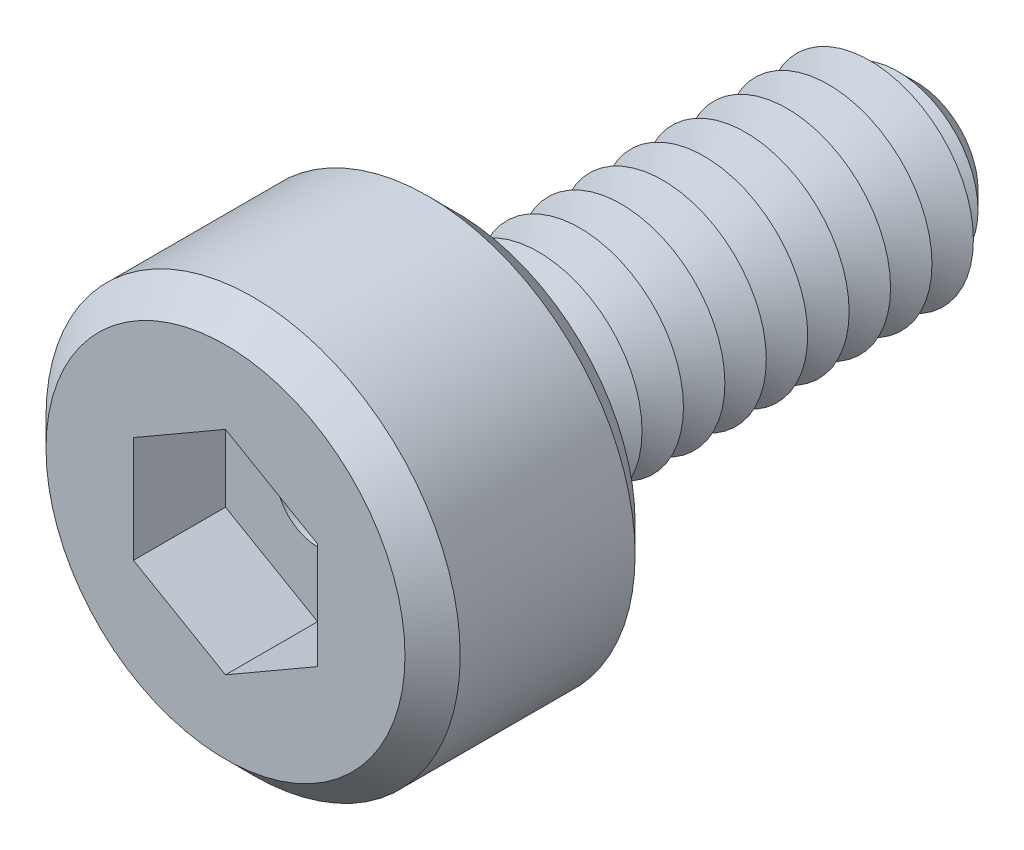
ISO-10303-21;
HEADER;
FILE_DESCRIPTION(('STEP AP214'),'2;1');
FILE_NAME('part.step','',(''),(''),'','','');
FILE_SCHEMA(('AUTOMOTIVE_DESIGN { 1 0 10303 214 1 1 1 1 }'));
ENDSEC;
DATA;
#1=APPLICATION_CONTEXT('core data for automotive mechanical design processes');
#2=APPLICATION_PROTOCOL_DEFINITION('international standard','automotive_design',2000,#1);
#3=PRODUCT_CONTEXT('',#1,'mechanical');
#4=PRODUCT('Part','Part','',(#3));
#5=PRODUCT_RELATED_PRODUCT_CATEGORY('part','',(#4));
#6=PRODUCT_DEFINITION_FORMATION('','',#4);
#7=PRODUCT_DEFINITION_CONTEXT('part definition',#1,'design');
#8=PRODUCT_DEFINITION('design','',#6,#7);
#9=PRODUCT_DEFINITION_SHAPE('','',#8);
#10=(LENGTH_UNIT() NAMED_UNIT(*) SI_UNIT(.MILLI.,.METRE.));
#11=(NAMED_UNIT(*) PLANE_ANGLE_UNIT() SI_UNIT($,.RADIAN.));
#12=(NAMED_UNIT(*) SI_UNIT($,.STERADIAN.) SOLID_ANGLE_UNIT());
#13=UNCERTAINTY_MEASURE_WITH_UNIT(LENGTH_MEASURE(1.E-05),#10,'distance_accuracy_value','');
#14=(GEOMETRIC_REPRESENTATION_CONTEXT(3) GLOBAL_UNCERTAINTY_ASSIGNED_CONTEXT((#13)) GLOBAL_UNIT_ASSIGNED_CONTEXT((#10,
#11,#12)) REPRESENTATION_CONTEXT('',''));
#15=CARTESIAN_POINT('',(0.,0.,0.));
#16=DIRECTION('',(0.,0.,1.));
#17=DIRECTION('',(1.,0.,0.));
#18=AXIS2_PLACEMENT_3D('',#15,#16,#17);
#19=CARTESIAN_POINT('',(0.,0.,2.5));
#20=DIRECTION('',(0.,0.,-1.));
#21=DIRECTION('',(-1.,0.,0.));
#22=AXIS2_PLACEMENT_3D('',#19,#20,#21);
#23=CYLINDRICAL_SURFACE('',#22,2.25);
#24=CARTESIAN_POINT('',(0.,0.,0.299999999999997));
#25=DIRECTION('',(0.,0.,1.));
#26=DIRECTION('',(1.,0.,0.));
#27=AXIS2_PLACEMENT_3D('',#24,#25,#26);
#28=CIRCLE('',#27,2.25);
#29=CARTESIAN_POINT('',(2.25,0.,0.299999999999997));
#30=VERTEX_POINT('',#29);
#31=EDGE_CURVE('E264',#30,#30,#28,.T.);
#32=ORIENTED_EDGE('',*,*,#31,.T.);
#33=EDGE_LOOP('',(#32));
#34=FACE_BOUND('',#33,.T.);
#35=CARTESIAN_POINT('',(0.,0.,2.2));
#36=DIRECTION('',(0.,0.,1.));
#37=DIRECTION('',(1.,0.,0.));
#38=AXIS2_PLACEMENT_3D('',#35,#36,#37);
#39=CIRCLE('',#38,2.25);
#40=CARTESIAN_POINT('',(2.25,0.,2.2));
#41=VERTEX_POINT('',#40);
#42=EDGE_CURVE('E257',#41,#41,#39,.F.);
#43=ORIENTED_EDGE('',*,*,#42,.T.);
#44=EDGE_LOOP('',(#43));
#45=FACE_BOUND('',#44,.T.);
#46=ADVANCED_FACE('F39',(#34,#45),#23,.T.);
#47=CARTESIAN_POINT('',(0.,0.,2.5));
#48=DIRECTION('',(0.,0.,1.));
#49=DIRECTION('',(1.,0.,0.));
#50=AXIS2_PLACEMENT_3D('',#47,#48,#49);
#51=PLANE('',#50);
#52=CARTESIAN_POINT('',(0.,0.,2.5));
#53=DIRECTION('',(0.,0.,1.));
#54=DIRECTION('',(1.,0.,0.));
#55=AXIS2_PLACEMENT_3D('',#52,#53,#54);
#56=CIRCLE('',#55,1.95);
#57=CARTESIAN_POINT('',(1.95,0.,2.5));
#58=VERTEX_POINT('',#57);
#59=EDGE_CURVE('E11',#58,#58,#56,.T.);
#60=ORIENTED_EDGE('',*,*,#59,.T.);
#61=EDGE_LOOP('',(#60));
#62=FACE_BOUND('',#61,.T.);
#63=DIRECTION('',(-0.866025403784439,0.5,0.));
#64=VECTOR('',#63,1.);
#65=CARTESIAN_POINT('',(0.999999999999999,0.577350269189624,2.5));
#66=LINE('',#65,#64);
#67=CARTESIAN_POINT('',(0.999999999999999,0.577350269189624,2.5));
#68=VERTEX_POINT('',#67);
#69=CARTESIAN_POINT('',(0.,1.15470053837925,2.5));
#70=VERTEX_POINT('',#69);
#71=EDGE_CURVE('E55',#68,#70,#66,.T.);
#72=ORIENTED_EDGE('',*,*,#71,.F.);
#73=DIRECTION('',(0.,1.,0.));
#74=VECTOR('',#73,1.);
#75=CARTESIAN_POINT('',(1.,-0.577350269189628,2.5));
#76=LINE('',#75,#74);
#77=CARTESIAN_POINT('',(1.,-0.577350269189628,2.5));
#78=VERTEX_POINT('',#77);
#79=EDGE_CURVE('E150',#78,#68,#76,.T.);
#80=ORIENTED_EDGE('',*,*,#79,.F.);
#81=DIRECTION('',(0.866025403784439,0.5,0.));
#82=VECTOR('',#81,1.);
#83=CARTESIAN_POINT('',(0.,-1.15470053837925,2.5));
#84=LINE('',#83,#82);
#85=CARTESIAN_POINT('',(0.,-1.15470053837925,2.5));
#86=VERTEX_POINT('',#85);
#87=EDGE_CURVE('E147',#86,#78,#84,.T.);
#88=ORIENTED_EDGE('',*,*,#87,.F.);
#89=DIRECTION('',(0.866025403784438,-0.5,0.));
#90=VECTOR('',#89,1.);
#91=CARTESIAN_POINT('',(-1.,-0.577350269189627,2.5));
#92=LINE('',#91,#90);
#93=CARTESIAN_POINT('',(-1.,-0.577350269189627,2.5));
#94=VERTEX_POINT('',#93);
#95=EDGE_CURVE('E103',#94,#86,#92,.T.);
#96=ORIENTED_EDGE('',*,*,#95,.F.);
#97=DIRECTION('',(0.,-1.,0.));
#98=VECTOR('',#97,1.);
#99=CARTESIAN_POINT('',(-1.,0.577350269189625,2.5));
#100=LINE('',#99,#98);
#101=CARTESIAN_POINT('',(-1.,0.577350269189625,2.5));
#102=VERTEX_POINT('',#101);
#103=EDGE_CURVE('E142',#102,#94,#100,.T.);
#104=ORIENTED_EDGE('',*,*,#103,.F.);
#105=DIRECTION('',(-0.866025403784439,-0.5,0.));
#106=VECTOR('',#105,1.);
#107=CARTESIAN_POINT('',(0.,1.15470053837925,2.5));
#108=LINE('',#107,#106);
#109=EDGE_CURVE('E137',#70,#102,#108,.T.);
#110=ORIENTED_EDGE('',*,*,#109,.F.);
#111=EDGE_LOOP('',(#72,#80,#88,#96,#104,#110));
#112=FACE_BOUND('',#111,.T.);
#113=ADVANCED_FACE('F282',(#62,#112),#51,.T.);
#114=CARTESIAN_POINT('',(0.,0.,0.));
#115=DIRECTION('',(0.,0.,1.));
#116=DIRECTION('',(1.,0.,0.));
#117=AXIS2_PLACEMENT_3D('',#114,#115,#116);
#118=PLANE('',#117);
#119=CARTESIAN_POINT('',(0.,0.,0.));
#120=DIRECTION('',(0.,0.,1.));
#121=DIRECTION('',(1.,0.,0.));
#122=AXIS2_PLACEMENT_3D('',#119,#120,#121);
#123=CIRCLE('',#122,1.95);
#124=CARTESIAN_POINT('',(1.95,0.,0.));
#125=VERTEX_POINT('',#124);
#126=EDGE_CURVE('E48',#125,#125,#123,.F.);
#127=ORIENTED_EDGE('',*,*,#126,.T.);
#128=EDGE_LOOP('',(#127));
#129=FACE_BOUND('',#128,.T.);
#130=CARTESIAN_POINT('',(0.,0.,0.));
#131=DIRECTION('',(0.,0.,1.));
#132=DIRECTION('',(1.,0.,0.));
#133=AXIS2_PLACEMENT_3D('',#130,#131,#132);
#134=CIRCLE('',#133,1.125);
#135=CARTESIAN_POINT('',(1.125,0.,0.));
#136=VERTEX_POINT('',#135);
#137=EDGE_CURVE('E249',#136,#136,#134,.T.);
#138=ORIENTED_EDGE('',*,*,#137,.T.);
#139=EDGE_LOOP('',(#138));
#140=FACE_BOUND('',#139,.T.);
#141=ADVANCED_FACE('F271',(#129,#140),#118,.F.);
#142=CARTESIAN_POINT('',(0.,0.,0.));
#143=DIRECTION('',(0.,0.,1.));
#144=DIRECTION('',(1.,0.,0.));
#145=AXIS2_PLACEMENT_3D('',#142,#143,#144);
#146=CONICAL_SURFACE('',#145,1.125,1.0471975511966);
#147=CARTESIAN_POINT('',(0.,0.,-0.225));
#148=DIRECTION('',(0.,0.,1.));
#149=DIRECTION('',(1.,0.,0.));
#150=AXIS2_PLACEMENT_3D('',#147,#148,#149);
#151=CIRCLE('',#150,0.735288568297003);
#152=CARTESIAN_POINT('',(0.735288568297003,0.,-0.225));
#153=VERTEX_POINT('',#152);
#154=EDGE_CURVE('E245',#153,#153,#151,.T.);
#155=ORIENTED_EDGE('',*,*,#154,.T.);
#156=EDGE_LOOP('',(#155));
#157=FACE_BOUND('',#156,.T.);
#158=ORIENTED_EDGE('',*,*,#137,.F.);
#159=EDGE_LOOP('',(#158));
#160=FACE_BOUND('',#159,.T.);
#161=ADVANCED_FACE('F420',(#157,#160),#146,.T.);
#162=CARTESIAN_POINT('',(0.,0.,-0.225));
#163=DIRECTION('',(0.,0.,-1.));
#164=DIRECTION('',(-1.,0.,0.));
#165=AXIS2_PLACEMENT_3D('',#162,#163,#164);
#166=CONICAL_SURFACE('',#165,0.735288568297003,1.0471975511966);
#167=CARTESIAN_POINT('',(0.,0.,-0.45));
#168=DIRECTION('',(0.,0.,1.));
#169=DIRECTION('',(1.,0.,0.));
#170=AXIS2_PLACEMENT_3D('',#167,#168,#169);
#171=CIRCLE('',#170,1.125);
#172=CARTESIAN_POINT('',(1.125,0.,-0.45));
#173=VERTEX_POINT('',#172);
#174=EDGE_CURVE('E241',#173,#173,#171,.T.);
#175=ORIENTED_EDGE('',*,*,#174,.T.);
#176=EDGE_LOOP('',(#175));
#177=FACE_BOUND('',#176,.T.);
#178=ORIENTED_EDGE('',*,*,#154,.F.);
#179=EDGE_LOOP('',(#178));
#180=FACE_BOUND('',#179,.T.);
#181=ADVANCED_FACE('F416',(#177,#180),#166,.T.);
#182=CARTESIAN_POINT('',(0.,0.,-0.45));
#183=DIRECTION('',(0.,0.,1.));
#184=DIRECTION('',(1.,0.,0.));
#185=AXIS2_PLACEMENT_3D('',#182,#183,#184);
#186=CONICAL_SURFACE('',#185,1.125,1.0471975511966);
#187=CARTESIAN_POINT('',(0.,0.,-0.675));
#188=DIRECTION('',(0.,0.,1.));
#189=DIRECTION('',(1.,0.,0.));
#190=AXIS2_PLACEMENT_3D('',#187,#188,#189);
#191=CIRCLE('',#190,0.735288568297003);
#192=CARTESIAN_POINT('',(0.735288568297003,0.,-0.675));
#193=VERTEX_POINT('',#192);
#194=EDGE_CURVE('E237',#193,#193,#191,.T.);
#195=ORIENTED_EDGE('',*,*,#194,.T.);
#196=EDGE_LOOP('',(#195));
#197=FACE_BOUND('',#196,.T.);
#198=ORIENTED_EDGE('',*,*,#174,.F.);
#199=EDGE_LOOP('',(#198));
#200=FACE_BOUND('',#199,.T.);
#201=ADVANCED_FACE('F412',(#197,#200),#186,.T.);
#202=CARTESIAN_POINT('',(0.,0.,-0.675));
#203=DIRECTION('',(0.,0.,-1.));
#204=DIRECTION('',(-1.,0.,0.));
#205=AXIS2_PLACEMENT_3D('',#202,#203,#204);
#206=CONICAL_SURFACE('',#205,0.735288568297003,1.0471975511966);
#207=CARTESIAN_POINT('',(0.,0.,-0.9));
#208=DIRECTION('',(0.,0.,1.));
#209=DIRECTION('',(1.,0.,0.));
#210=AXIS2_PLACEMENT_3D('',#207,#208,#209);
#211=CIRCLE('',#210,1.125);
#212=CARTESIAN_POINT('',(1.125,0.,-0.9));
#213=VERTEX_POINT('',#212);
#214=EDGE_CURVE('E233',#213,#213,#211,.T.);
#215=ORIENTED_EDGE('',*,*,#214,.T.);
#216=EDGE_LOOP('',(#215));
#217=FACE_BOUND('',#216,.T.);
#218=ORIENTED_EDGE('',*,*,#194,.F.);
#219=EDGE_LOOP('',(#218));
#220=FACE_BOUND('',#219,.T.);
#221=ADVANCED_FACE('F408',(#217,#220),#206,.T.);
#222=CARTESIAN_POINT('',(0.,0.,-0.9));
#223=DIRECTION('',(0.,0.,1.));
#224=DIRECTION('',(1.,0.,0.));
#225=AXIS2_PLACEMENT_3D('',#222,#223,#224);
#226=CONICAL_SURFACE('',#225,1.125,1.0471975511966);
#227=CARTESIAN_POINT('',(0.,0.,-1.125));
#228=DIRECTION('',(0.,0.,1.));
#229=DIRECTION('',(1.,0.,0.));
#230=AXIS2_PLACEMENT_3D('',#227,#228,#229);
#231=CIRCLE('',#230,0.735288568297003);
#232=CARTESIAN_POINT('',(0.735288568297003,0.,-1.125));
#233=VERTEX_POINT('',#232);
#234=EDGE_CURVE('E229',#233,#233,#231,.T.);
#235=ORIENTED_EDGE('',*,*,#234,.T.);
#236=EDGE_LOOP('',(#235));
#237=FACE_BOUND('',#236,.T.);
#238=ORIENTED_EDGE('',*,*,#214,.F.);
#239=EDGE_LOOP('',(#238));
#240=FACE_BOUND('',#239,.T.);
#241=ADVANCED_FACE('F404',(#237,#240),#226,.T.);
#242=CARTESIAN_POINT('',(0.,0.,-1.125));
#243=DIRECTION('',(0.,0.,-1.));
#244=DIRECTION('',(-1.,0.,0.));
#245=AXIS2_PLACEMENT_3D('',#242,#243,#244);
#246=CONICAL_SURFACE('',#245,0.735288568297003,1.0471975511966);
#247=CARTESIAN_POINT('',(0.,0.,-1.35));
#248=DIRECTION('',(0.,0.,1.));
#249=DIRECTION('',(1.,0.,0.));
#250=AXIS2_PLACEMENT_3D('',#247,#248,#249);
#251=CIRCLE('',#250,1.125);
#252=CARTESIAN_POINT('',(1.125,0.,-1.35));
#253=VERTEX_POINT('',#252);
#254=EDGE_CURVE('E225',#253,#253,#251,.T.);
#255=ORIENTED_EDGE('',*,*,#254,.T.);
#256=EDGE_LOOP('',(#255));
#257=FACE_BOUND('',#256,.T.);
#258=ORIENTED_EDGE('',*,*,#234,.F.);
#259=EDGE_LOOP('',(#258));
#260=FACE_BOUND('',#259,.T.);
#261=ADVANCED_FACE('F400',(#257,#260),#246,.T.);
#262=CARTESIAN_POINT('',(0.,0.,-1.35));
#263=DIRECTION('',(0.,0.,1.));
#264=DIRECTION('',(1.,0.,0.));
#265=AXIS2_PLACEMENT_3D('',#262,#263,#264);
#266=CONICAL_SURFACE('',#265,1.125,1.0471975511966);
#267=CARTESIAN_POINT('',(0.,0.,-1.575));
#268=DIRECTION('',(0.,0.,1.));
#269=DIRECTION('',(1.,0.,0.));
#270=AXIS2_PLACEMENT_3D('',#267,#268,#269);
#271=CIRCLE('',#270,0.735288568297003);
#272=CARTESIAN_POINT('',(0.735288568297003,0.,-1.575));
#273=VERTEX_POINT('',#272);
#274=EDGE_CURVE('E221',#273,#273,#271,.T.);
#275=ORIENTED_EDGE('',*,*,#274,.T.);
#276=EDGE_LOOP('',(#275));
#277=FACE_BOUND('',#276,.T.);
#278=ORIENTED_EDGE('',*,*,#254,.F.);
#279=EDGE_LOOP('',(#278));
#280=FACE_BOUND('',#279,.T.);
#281=ADVANCED_FACE('F396',(#277,#280),#266,.T.);
#282=CARTESIAN_POINT('',(0.,0.,-1.575));
#283=DIRECTION('',(0.,0.,-1.));
#284=DIRECTION('',(-1.,0.,0.));
#285=AXIS2_PLACEMENT_3D('',#282,#283,#284);
#286=CONICAL_SURFACE('',#285,0.735288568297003,1.0471975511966);
#287=CARTESIAN_POINT('',(0.,0.,-1.8));
#288=DIRECTION('',(0.,0.,1.));
#289=DIRECTION('',(1.,0.,0.));
#290=AXIS2_PLACEMENT_3D('',#287,#288,#289);
#291=CIRCLE('',#290,1.125);
#292=CARTESIAN_POINT('',(1.125,0.,-1.8));
#293=VERTEX_POINT('',#292);
#294=EDGE_CURVE('E218',#293,#293,#291,.T.);
#295=ORIENTED_EDGE('',*,*,#294,.T.);
#296=EDGE_LOOP('',(#295));
#297=FACE_BOUND('',#296,.T.);
#298=ORIENTED_EDGE('',*,*,#274,.F.);
#299=EDGE_LOOP('',(#298));
#300=FACE_BOUND('',#299,.T.);
#301=ADVANCED_FACE('F392',(#297,#300),#286,.T.);
#302=CARTESIAN_POINT('',(0.,0.,-1.8));
#303=DIRECTION('',(0.,0.,1.));
#304=DIRECTION('',(1.,0.,0.));
#305=AXIS2_PLACEMENT_3D('',#302,#303,#304);
#306=CONICAL_SURFACE('',#305,1.125,1.0471975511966);
#307=CARTESIAN_POINT('',(0.,0.,-2.025));
#308=DIRECTION('',(0.,0.,1.));
#309=DIRECTION('',(1.,0.,0.));
#310=AXIS2_PLACEMENT_3D('',#307,#308,#309);
#311=CIRCLE('',#310,0.735288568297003);
#312=CARTESIAN_POINT('',(0.735288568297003,0.,-2.025));
#313=VERTEX_POINT('',#312);
#314=EDGE_CURVE('E214',#313,#313,#311,.T.);
#315=ORIENTED_EDGE('',*,*,#314,.T.);
#316=EDGE_LOOP('',(#315));
#317=FACE_BOUND('',#316,.T.);
#318=ORIENTED_EDGE('',*,*,#294,.F.);
#319=EDGE_LOOP('',(#318));
#320=FACE_BOUND('',#319,.T.);
#321=ADVANCED_FACE('F388',(#317,#320),#306,.T.);
#322=CARTESIAN_POINT('',(0.,0.,-2.025));
#323=DIRECTION('',(0.,0.,-1.));
#324=DIRECTION('',(-1.,0.,0.));
#325=AXIS2_PLACEMENT_3D('',#322,#323,#324);
#326=CONICAL_SURFACE('',#325,0.735288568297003,1.0471975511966);
#327=CARTESIAN_POINT('',(0.,0.,-2.25));
#328=DIRECTION('',(0.,0.,1.));
#329=DIRECTION('',(1.,0.,0.));
#330=AXIS2_PLACEMENT_3D('',#327,#328,#329);
#331=CIRCLE('',#330,1.125);
#332=CARTESIAN_POINT('',(1.125,0.,-2.25));
#333=VERTEX_POINT('',#332);
#334=EDGE_CURVE('E210',#333,#333,#331,.T.);
#335=ORIENTED_EDGE('',*,*,#334,.T.);
#336=EDGE_LOOP('',(#335));
#337=FACE_BOUND('',#336,.T.);
#338=ORIENTED_EDGE('',*,*,#314,.F.);
#339=EDGE_LOOP('',(#338));
#340=FACE_BOUND('',#339,.T.);
#341=ADVANCED_FACE('F384',(#337,#340),#326,.T.);
#342=CARTESIAN_POINT('',(0.,0.,-2.25));
#343=DIRECTION('',(0.,0.,1.));
#344=DIRECTION('',(1.,0.,0.));
#345=AXIS2_PLACEMENT_3D('',#342,#343,#344);
#346=CONICAL_SURFACE('',#345,1.125,1.0471975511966);
#347=CARTESIAN_POINT('',(0.,0.,-2.475));
#348=DIRECTION('',(0.,0.,1.));
#349=DIRECTION('',(1.,0.,0.));
#350=AXIS2_PLACEMENT_3D('',#347,#348,#349);
#351=CIRCLE('',#350,0.735288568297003);
#352=CARTESIAN_POINT('',(0.735288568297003,0.,-2.475));
#353=VERTEX_POINT('',#352);
#354=EDGE_CURVE('E206',#353,#353,#351,.T.);
#355=ORIENTED_EDGE('',*,*,#354,.T.);
#356=EDGE_LOOP('',(#355));
#357=FACE_BOUND('',#356,.T.);
#358=ORIENTED_EDGE('',*,*,#334,.F.);
#359=EDGE_LOOP('',(#358));
#360=FACE_BOUND('',#359,.T.);
#361=ADVANCED_FACE('F380',(#357,#360),#346,.T.);
#362=CARTESIAN_POINT('',(0.,0.,-2.475));
#363=DIRECTION('',(0.,0.,-1.));
#364=DIRECTION('',(-1.,0.,0.));
#365=AXIS2_PLACEMENT_3D('',#362,#363,#364);
#366=CONICAL_SURFACE('',#365,0.735288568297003,1.0471975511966);
#367=CARTESIAN_POINT('',(0.,0.,-2.7));
#368=DIRECTION('',(0.,0.,1.));
#369=DIRECTION('',(1.,0.,0.));
#370=AXIS2_PLACEMENT_3D('',#367,#368,#369);
#371=CIRCLE('',#370,1.125);
#372=CARTESIAN_POINT('',(1.125,0.,-2.7));
#373=VERTEX_POINT('',#372);
#374=EDGE_CURVE('E202',#373,#373,#371,.T.);
#375=ORIENTED_EDGE('',*,*,#374,.T.);
#376=EDGE_LOOP('',(#375));
#377=FACE_BOUND('',#376,.T.);
#378=ORIENTED_EDGE('',*,*,#354,.F.);
#379=EDGE_LOOP('',(#378));
#380=FACE_BOUND('',#379,.T.);
#381=ADVANCED_FACE('F376',(#377,#380),#366,.T.);
#382=CARTESIAN_POINT('',(0.,0.,-2.7));
#383=DIRECTION('',(0.,0.,1.));
#384=DIRECTION('',(1.,0.,0.));
#385=AXIS2_PLACEMENT_3D('',#382,#383,#384);
#386=CONICAL_SURFACE('',#385,1.125,1.0471975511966);
#387=CARTESIAN_POINT('',(0.,0.,-2.925));
#388=DIRECTION('',(0.,0.,1.));
#389=DIRECTION('',(1.,0.,0.));
#390=AXIS2_PLACEMENT_3D('',#387,#388,#389);
#391=CIRCLE('',#390,0.735288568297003);
#392=CARTESIAN_POINT('',(0.735288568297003,0.,-2.925));
#393=VERTEX_POINT('',#392);
#394=EDGE_CURVE('E198',#393,#393,#391,.T.);
#395=ORIENTED_EDGE('',*,*,#394,.T.);
#396=EDGE_LOOP('',(#395));
#397=FACE_BOUND('',#396,.T.);
#398=ORIENTED_EDGE('',*,*,#374,.F.);
#399=EDGE_LOOP('',(#398));
#400=FACE_BOUND('',#399,.T.);
#401=ADVANCED_FACE('F372',(#397,#400),#386,.T.);
#402=CARTESIAN_POINT('',(0.,0.,-2.925));
#403=DIRECTION('',(0.,0.,-1.));
#404=DIRECTION('',(-1.,0.,0.));
#405=AXIS2_PLACEMENT_3D('',#402,#403,#404);
#406=CONICAL_SURFACE('',#405,0.735288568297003,1.0471975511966);
#407=CARTESIAN_POINT('',(0.,0.,-3.15));
#408=DIRECTION('',(0.,0.,1.));
#409=DIRECTION('',(1.,0.,0.));
#410=AXIS2_PLACEMENT_3D('',#407,#408,#409);
#411=CIRCLE('',#410,1.125);
#412=CARTESIAN_POINT('',(1.125,0.,-3.15));
#413=VERTEX_POINT('',#412);
#414=EDGE_CURVE('E194',#413,#413,#411,.T.);
#415=ORIENTED_EDGE('',*,*,#414,.T.);
#416=EDGE_LOOP('',(#415));
#417=FACE_BOUND('',#416,.T.);
#418=ORIENTED_EDGE('',*,*,#394,.F.);
#419=EDGE_LOOP('',(#418));
#420=FACE_BOUND('',#419,.T.);
#421=ADVANCED_FACE('F368',(#417,#420),#406,.T.);
#422=CARTESIAN_POINT('',(0.,0.,-3.15));
#423=DIRECTION('',(0.,0.,1.));
#424=DIRECTION('',(1.,0.,0.));
#425=AXIS2_PLACEMENT_3D('',#422,#423,#424);
#426=CONICAL_SURFACE('',#425,1.125,1.0471975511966);
#427=CARTESIAN_POINT('',(0.,0.,-3.375));
#428=DIRECTION('',(0.,0.,1.));
#429=DIRECTION('',(1.,0.,0.));
#430=AXIS2_PLACEMENT_3D('',#427,#428,#429);
#431=CIRCLE('',#430,0.735288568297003);
#432=CARTESIAN_POINT('',(0.735288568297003,0.,-3.375));
#433=VERTEX_POINT('',#432);
#434=EDGE_CURVE('E190',#433,#433,#431,.T.);
#435=ORIENTED_EDGE('',*,*,#434,.T.);
#436=EDGE_LOOP('',(#435));
#437=FACE_BOUND('',#436,.T.);
#438=ORIENTED_EDGE('',*,*,#414,.F.);
#439=EDGE_LOOP('',(#438));
#440=FACE_BOUND('',#439,.T.);
#441=ADVANCED_FACE('F364',(#437,#440),#426,.T.);
#442=CARTESIAN_POINT('',(0.,0.,-3.375));
#443=DIRECTION('',(0.,0.,-1.));
#444=DIRECTION('',(-1.,0.,0.));
#445=AXIS2_PLACEMENT_3D('',#442,#443,#444);
#446=CONICAL_SURFACE('',#445,0.735288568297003,1.0471975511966);
#447=CARTESIAN_POINT('',(0.,0.,-3.6));
#448=DIRECTION('',(0.,0.,1.));
#449=DIRECTION('',(1.,0.,0.));
#450=AXIS2_PLACEMENT_3D('',#447,#448,#449);
#451=CIRCLE('',#450,1.125);
#452=CARTESIAN_POINT('',(1.125,0.,-3.6));
#453=VERTEX_POINT('',#452);
#454=EDGE_CURVE('E186',#453,#453,#451,.T.);
#455=ORIENTED_EDGE('',*,*,#454,.T.);
#456=EDGE_LOOP('',(#455));
#457=FACE_BOUND('',#456,.T.);
#458=ORIENTED_EDGE('',*,*,#434,.F.);
#459=EDGE_LOOP('',(#458));
#460=FACE_BOUND('',#459,.T.);
#461=ADVANCED_FACE('F360',(#457,#460),#446,.T.);
#462=CARTESIAN_POINT('',(0.,0.,-3.6));
#463=DIRECTION('',(0.,0.,1.));
#464=DIRECTION('',(1.,0.,0.));
#465=AXIS2_PLACEMENT_3D('',#462,#463,#464);
#466=CONICAL_SURFACE('',#465,1.125,1.0471975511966);
#467=CARTESIAN_POINT('',(0.,0.,-3.825));
#468=DIRECTION('',(0.,0.,1.));
#469=DIRECTION('',(1.,0.,0.));
#470=AXIS2_PLACEMENT_3D('',#467,#468,#469);
#471=CIRCLE('',#470,0.735288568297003);
#472=CARTESIAN_POINT('',(0.735288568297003,0.,-3.825));
#473=VERTEX_POINT('',#472);
#474=EDGE_CURVE('E182',#473,#473,#471,.T.);
#475=ORIENTED_EDGE('',*,*,#474,.T.);
#476=EDGE_LOOP('',(#475));
#477=FACE_BOUND('',#476,.T.);
#478=ORIENTED_EDGE('',*,*,#454,.F.);
#479=EDGE_LOOP('',(#478));
#480=FACE_BOUND('',#479,.T.);
#481=ADVANCED_FACE('F356',(#477,#480),#466,.T.);
#482=CARTESIAN_POINT('',(0.,0.,-3.825));
#483=DIRECTION('',(0.,0.,-1.));
#484=DIRECTION('',(-1.,0.,0.));
#485=AXIS2_PLACEMENT_3D('',#482,#483,#484);
#486=CONICAL_SURFACE('',#485,0.735288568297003,1.0471975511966);
#487=CARTESIAN_POINT('',(0.,0.,-4.05));
#488=DIRECTION('',(0.,0.,1.));
#489=DIRECTION('',(1.,0.,0.));
#490=AXIS2_PLACEMENT_3D('',#487,#488,#489);
#491=CIRCLE('',#490,1.125);
#492=CARTESIAN_POINT('',(1.125,0.,-4.05));
#493=VERTEX_POINT('',#492);
#494=EDGE_CURVE('E178',#493,#493,#491,.T.);
#495=ORIENTED_EDGE('',*,*,#494,.T.);
#496=EDGE_LOOP('',(#495));
#497=FACE_BOUND('',#496,.T.);
#498=ORIENTED_EDGE('',*,*,#474,.F.);
#499=EDGE_LOOP('',(#498));
#500=FACE_BOUND('',#499,.T.);
#501=ADVANCED_FACE('F352',(#497,#500),#486,.T.);
#502=CARTESIAN_POINT('',(0.,0.,-4.05));
#503=DIRECTION('',(0.,0.,1.));
#504=DIRECTION('',(1.,0.,0.));
#505=AXIS2_PLACEMENT_3D('',#502,#503,#504);
#506=CONICAL_SURFACE('',#505,1.125,1.0471975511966);
#507=CARTESIAN_POINT('',(0.,0.,-4.275));
#508=DIRECTION('',(0.,0.,1.));
#509=DIRECTION('',(1.,0.,0.));
#510=AXIS2_PLACEMENT_3D('',#507,#508,#509);
#511=CIRCLE('',#510,0.735288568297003);
#512=CARTESIAN_POINT('',(0.735288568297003,0.,-4.275));
#513=VERTEX_POINT('',#512);
#514=EDGE_CURVE('E174',#513,#513,#511,.T.);
#515=ORIENTED_EDGE('',*,*,#514,.T.);
#516=EDGE_LOOP('',(#515));
#517=FACE_BOUND('',#516,.T.);
#518=ORIENTED_EDGE('',*,*,#494,.F.);
#519=EDGE_LOOP('',(#518));
#520=FACE_BOUND('',#519,.T.);
#521=ADVANCED_FACE('F348',(#517,#520),#506,.T.);
#522=CARTESIAN_POINT('',(0.,0.,-4.275));
#523=DIRECTION('',(0.,0.,-1.));
#524=DIRECTION('',(-1.,0.,0.));
#525=AXIS2_PLACEMENT_3D('',#522,#523,#524);
#526=CONICAL_SURFACE('',#525,0.735288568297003,1.0471975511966);
#527=CARTESIAN_POINT('',(0.,0.,-4.5));
#528=DIRECTION('',(0.,0.,1.));
#529=DIRECTION('',(1.,0.,0.));
#530=AXIS2_PLACEMENT_3D('',#527,#528,#529);
#531=CIRCLE('',#530,1.125);
#532=CARTESIAN_POINT('',(1.125,0.,-4.5));
#533=VERTEX_POINT('',#532);
#534=EDGE_CURVE('E169',#533,#533,#531,.T.);
#535=ORIENTED_EDGE('',*,*,#534,.T.);
#536=EDGE_LOOP('',(#535));
#537=FACE_BOUND('',#536,.T.);
#538=ORIENTED_EDGE('',*,*,#514,.F.);
#539=EDGE_LOOP('',(#538));
#540=FACE_BOUND('',#539,.T.);
#541=ADVANCED_FACE('F344',(#537,#540),#526,.T.);
#542=CARTESIAN_POINT('',(0.,0.,-4.5));
#543=DIRECTION('',(0.,0.,1.));
#544=DIRECTION('',(1.,0.,0.));
#545=AXIS2_PLACEMENT_3D('',#542,#543,#544);
#546=CONICAL_SURFACE('',#545,1.125,1.0471975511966);
#547=CARTESIAN_POINT('',(0.,0.,-4.725));
#548=DIRECTION('',(0.,0.,1.));
#549=DIRECTION('',(1.,0.,0.));
#550=AXIS2_PLACEMENT_3D('',#547,#548,#549);
#551=CIRCLE('',#550,0.735288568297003);
#552=CARTESIAN_POINT('',(0.735288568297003,0.,-4.725));
#553=VERTEX_POINT('',#552);
#554=EDGE_CURVE('E156',#553,#553,#551,.T.);
#555=ORIENTED_EDGE('',*,*,#554,.T.);
#556=EDGE_LOOP('',(#555));
#557=FACE_BOUND('',#556,.T.);
#558=ORIENTED_EDGE('',*,*,#534,.F.);
#559=EDGE_LOOP('',(#558));
#560=FACE_BOUND('',#559,.T.);
#561=ADVANCED_FACE('F340',(#557,#560),#546,.T.);
#562=CARTESIAN_POINT('',(0.,0.,-4.725));
#563=DIRECTION('',(0.,0.,-1.));
#564=DIRECTION('',(-1.,0.,0.));
#565=AXIS2_PLACEMENT_3D('',#562,#563,#564);
#566=CONICAL_SURFACE('',#565,0.735288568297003,1.0471975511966);
#567=CARTESIAN_POINT('',(0.,0.,-4.80358983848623));
#568=DIRECTION('',(0.,0.,-1.));
#569=DIRECTION('',(-1.,0.,0.));
#570=AXIS2_PLACEMENT_3D('',#567,#568,#569);
#571=CIRCLE('',#570,0.871410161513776);
#572=CARTESIAN_POINT('',(0.871410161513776,0.,-4.80358983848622));
#573=VERTEX_POINT('',#572);
#574=EDGE_CURVE('E173',#573,#573,#571,.T.);
#575=ORIENTED_EDGE('',*,*,#574,.F.);
#576=EDGE_LOOP('',(#575));
#577=FACE_BOUND('',#576,.T.);
#578=ORIENTED_EDGE('',*,*,#554,.F.);
#579=EDGE_LOOP('',(#578));
#580=FACE_BOUND('',#579,.T.);
#581=ADVANCED_FACE('F336',(#577,#580),#566,.T.);
#582=CARTESIAN_POINT('',(0.,0.,-5.));
#583=DIRECTION('',(0.,0.,-1.));
#584=DIRECTION('',(-1.,0.,0.));
#585=AXIS2_PLACEMENT_3D('',#582,#583,#584);
#586=PLANE('',#585);
#587=CARTESIAN_POINT('',(0.,0.,-5.));
#588=DIRECTION('',(0.,0.,-1.));
#589=DIRECTION('',(-1.,0.,0.));
#590=AXIS2_PLACEMENT_3D('',#587,#588,#589);
#591=CIRCLE('',#590,0.45);
#592=CARTESIAN_POINT('',(-0.45,0.,-5.));
#593=VERTEX_POINT('',#592);
#594=EDGE_CURVE('E138',#593,#593,#591,.F.);
#595=ORIENTED_EDGE('',*,*,#594,.T.);
#596=EDGE_LOOP('',(#595));
#597=FACE_BOUND('',#596,.T.);
#598=CARTESIAN_POINT('',(0.,0.,-5.));
#599=DIRECTION('',(0.,0.,-1.));
#600=DIRECTION('',(-1.,0.,0.));
#601=AXIS2_PLACEMENT_3D('',#598,#599,#600);
#602=CIRCLE('',#601,0.675000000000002);
#603=CARTESIAN_POINT('',(0.675000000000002,0.,-5.));
#604=VERTEX_POINT('',#603);
#605=EDGE_CURVE('E253',#604,#604,#602,.T.);
#606=ORIENTED_EDGE('',*,*,#605,.T.);
#607=EDGE_LOOP('',(#606));
#608=FACE_BOUND('',#607,.T.);
#609=ADVANCED_FACE('F339',(#597,#608),#586,.T.);
#610=CARTESIAN_POINT('',(0.,0.,-5.));
#611=DIRECTION('',(0.,0.,1.));
#612=DIRECTION('',(1.,0.,0.));
#613=AXIS2_PLACEMENT_3D('',#610,#611,#612);
#614=CONICAL_SURFACE('',#613,0.675000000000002,0.785398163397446);
#615=CARTESIAN_POINT('',(0.675000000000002,0.,-5.));
#616=CARTESIAN_POINT('',(0.677045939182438,0.,-4.99795406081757));
#617=CARTESIAN_POINT('',(0.679091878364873,0.,-4.99590812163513));
#618=CARTESIAN_POINT('',(0.683183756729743,0.,-4.99181624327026));
#619=CARTESIAN_POINT('',(0.685229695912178,0.,-4.98977030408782));
#620=CARTESIAN_POINT('',(0.689321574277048,0.,-4.98567842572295));
#621=CARTESIAN_POINT('',(0.691367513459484,0.,-4.98363248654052));
#622=CARTESIAN_POINT('',(0.695459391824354,0.,-4.97954060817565));
#623=CARTESIAN_POINT('',(0.697505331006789,0.,-4.97749466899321));
#624=CARTESIAN_POINT('',(0.701597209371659,0.,-4.97340279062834));
#625=CARTESIAN_POINT('',(0.703643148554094,0.,-4.97135685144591));
#626=CARTESIAN_POINT('',(0.707735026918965,0.,-4.96726497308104));
#627=CARTESIAN_POINT('',(0.7097809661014,0.,-4.9652190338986));
#628=CARTESIAN_POINT('',(0.71387284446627,0.,-4.96112715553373));
#629=CARTESIAN_POINT('',(0.715918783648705,0.,-4.9590812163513));
#630=CARTESIAN_POINT('',(0.720010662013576,0.,-4.95498933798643));
#631=CARTESIAN_POINT('',(0.722056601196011,0.,-4.95294339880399));
#632=CARTESIAN_POINT('',(0.726148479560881,0.,-4.94885152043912));
#633=CARTESIAN_POINT('',(0.728194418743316,0.,-4.94680558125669));
#634=CARTESIAN_POINT('',(0.732286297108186,0.,-4.94271370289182));
#635=CARTESIAN_POINT('',(0.734332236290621,0.,-4.94066776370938));
#636=CARTESIAN_POINT('',(0.738424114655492,0.,-4.93657588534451));
#637=CARTESIAN_POINT('',(0.740470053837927,0.,-4.93452994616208));
#638=CARTESIAN_POINT('',(0.744561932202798,0.,-4.9304380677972));
#639=CARTESIAN_POINT('',(0.746607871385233,0.,-4.92839212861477));
#640=CARTESIAN_POINT('',(0.750699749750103,0.,-4.9243002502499));
#641=CARTESIAN_POINT('',(0.752745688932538,0.,-4.92225431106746));
#642=CARTESIAN_POINT('',(0.756837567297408,0.,-4.91816243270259));
#643=CARTESIAN_POINT('',(0.758883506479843,0.,-4.91611649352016));
#644=CARTESIAN_POINT('',(0.762975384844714,0.,-4.91202461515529));
#645=CARTESIAN_POINT('',(0.765021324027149,0.,-4.90997867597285));
#646=CARTESIAN_POINT('',(0.769113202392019,0.,-4.90588679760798));
#647=CARTESIAN_POINT('',(0.771159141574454,0.,-4.90384085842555));
#648=CARTESIAN_POINT('',(0.775251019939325,0.,-4.89974898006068));
#649=CARTESIAN_POINT('',(0.77729695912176,0.,-4.89770304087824));
#650=CARTESIAN_POINT('',(0.78138883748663,0.,-4.89361116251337));
#651=CARTESIAN_POINT('',(0.783434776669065,0.,-4.89156522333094));
#652=CARTESIAN_POINT('',(0.787526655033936,0.,-4.88747334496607));
#653=CARTESIAN_POINT('',(0.78957259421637,0.,-4.88542740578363));
#654=CARTESIAN_POINT('',(0.793664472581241,0.,-4.88133552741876));
#655=CARTESIAN_POINT('',(0.795710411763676,0.,-4.87928958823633));
#656=CARTESIAN_POINT('',(0.799802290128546,0.,-4.87519770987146));
#657=CARTESIAN_POINT('',(0.801848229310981,0.,-4.87315177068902));
#658=CARTESIAN_POINT('',(0.805940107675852,0.,-4.86905989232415));
#659=CARTESIAN_POINT('',(0.807986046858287,0.,-4.86701395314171));
#660=CARTESIAN_POINT('',(0.812077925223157,0.,-4.86292207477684));
#661=CARTESIAN_POINT('',(0.814123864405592,0.,-4.86087613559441));
#662=CARTESIAN_POINT('',(0.818215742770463,0.,-4.85678425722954));
#663=CARTESIAN_POINT('',(0.820261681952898,0.,-4.8547383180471));
#664=CARTESIAN_POINT('',(0.824353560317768,0.,-4.85064643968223));
#665=CARTESIAN_POINT('',(0.826399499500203,0.,-4.8486005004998));
#666=CARTESIAN_POINT('',(0.830491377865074,0.,-4.84450862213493));
#667=CARTESIAN_POINT('',(0.832537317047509,0.,-4.84246268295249));
#668=CARTESIAN_POINT('',(0.836629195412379,0.,-4.83837080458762));
#669=CARTESIAN_POINT('',(0.838675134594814,0.,-4.83632486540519));
#670=CARTESIAN_POINT('',(0.842767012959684,0.,-4.83223298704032));
#671=CARTESIAN_POINT('',(0.844812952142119,0.,-4.83018704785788));
#672=CARTESIAN_POINT('',(0.84890483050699,0.,-4.82609516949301));
#673=CARTESIAN_POINT('',(0.850950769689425,0.,-4.82404923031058));
#674=CARTESIAN_POINT('',(0.855042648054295,0.,-4.81995735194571));
#675=CARTESIAN_POINT('',(0.85708858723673,0.,-4.81791141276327));
#676=CARTESIAN_POINT('',(0.861180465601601,0.,-4.8138195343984));
#677=CARTESIAN_POINT('',(0.863226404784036,0.,-4.81177359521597));
#678=CARTESIAN_POINT('',(0.867318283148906,0.,-4.8076817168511));
#679=CARTESIAN_POINT('',(0.869364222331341,0.,-4.80563577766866));
#680=CARTESIAN_POINT('',(0.871410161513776,0.,-4.80358983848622));
#681=B_SPLINE_CURVE_WITH_KNOTS('',3,(#615,#616,#617,#618,#619,#620,#621,#622,#623,#624,#625,
#626,#627,#628,#629,#630,#631,#632,#633,#634,#635,#636,#637,#638,#639,#640,#641,#642,#643,#644,
#645,#646,#647,#648,#649,#650,#651,#652,#653,#654,#655,#656,#657,#658,#659,#660,#661,#662,#663,
#664,#665,#666,#667,#668,#669,#670,#671,#672,#673,#674,#675,#676,#677,#678,#679,#680),
.UNSPECIFIED.,.F.,.F.,(4,2,2,2,2,2,2,2,2,2,2,2,2,2,2,2,2,2,2,2,2,2,2,2,2,2,2,2,2,2,2,2,4),(0.,
0.00868018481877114,0.0173603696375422,0.0260405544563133,0.0347207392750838,0.0434009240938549,
0.052081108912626,0.0607612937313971,0.0694414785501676,0.0781216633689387,0.0868018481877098,
0.0954820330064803,0.104162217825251,0.112842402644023,0.121522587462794,0.130202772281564,
0.138882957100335,0.147563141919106,0.156243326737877,0.164923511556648,0.173603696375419,
0.18228388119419,0.190964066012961,0.199644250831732,0.208324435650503,0.217004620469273,
0.225684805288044,0.234364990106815,0.243045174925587,0.251725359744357,0.260405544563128,
0.269085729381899,0.27776591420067),.UNSPECIFIED.);
#682=EDGE_CURVE('BSEAM335',#604,#573,#681,.T.);
#683=ORIENTED_EDGE('',*,*,#605,.F.);
#684=ORIENTED_EDGE('',*,*,#574,.T.);
#685=ORIENTED_EDGE('',*,*,#682,.T.);
#686=ORIENTED_EDGE('',*,*,#682,.F.);
#687=EDGE_LOOP('',(#683,#685,#684,#686));
#688=FACE_BOUND('',#687,.T.);
#689=ADVANCED_FACE('F335',(#688),#614,.T.);
#690=CARTESIAN_POINT('',(0.999999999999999,0.577350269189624,1.5));
#691=DIRECTION('',(0.5,0.866025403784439,0.));
#692=DIRECTION('',(-0.866025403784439,0.5,0.));
#693=AXIS2_PLACEMENT_3D('',#690,#691,#692);
#694=PLANE('',#693);
#695=ORIENTED_EDGE('',*,*,#71,.T.);
#696=DIRECTION('',(0.,0.,1.));
#697=VECTOR('',#696,1.);
#698=CARTESIAN_POINT('',(0.,1.15470053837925,1.5));
#699=LINE('',#698,#697);
#700=CARTESIAN_POINT('',(0.,1.15470053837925,1.5));
#701=VERTEX_POINT('',#700);
#702=EDGE_CURVE('E85',#701,#70,#699,.T.);
#703=ORIENTED_EDGE('',*,*,#702,.F.);
#704=DIRECTION('',(-0.866025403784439,0.5,0.));
#705=VECTOR('',#704,1.);
#706=CARTESIAN_POINT('',(0.999999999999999,0.577350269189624,1.5));
#707=LINE('',#706,#705);
#708=CARTESIAN_POINT('',(0.999999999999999,0.577350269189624,1.5));
#709=VERTEX_POINT('',#708);
#710=EDGE_CURVE('E153',#709,#701,#707,.T.);
#711=ORIENTED_EDGE('',*,*,#710,.F.);
#712=DIRECTION('',(0.,0.,1.));
#713=VECTOR('',#712,1.);
#714=CARTESIAN_POINT('',(0.999999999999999,0.577350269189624,1.5));
#715=LINE('',#714,#713);
#716=EDGE_CURVE('E63',#709,#68,#715,.T.);
#717=ORIENTED_EDGE('',*,*,#716,.T.);
#718=EDGE_LOOP('',(#695,#703,#711,#717));
#719=FACE_BOUND('',#718,.T.);
#720=ADVANCED_FACE('F325',(#719),#694,.F.);
#721=CARTESIAN_POINT('',(1.,-0.577350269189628,1.5));
#722=DIRECTION('',(1.,0.,0.));
#723=DIRECTION('',(0.,1.,0.));
#724=AXIS2_PLACEMENT_3D('',#721,#722,#723);
#725=PLANE('',#724);
#726=ORIENTED_EDGE('',*,*,#79,.T.);
#727=ORIENTED_EDGE('',*,*,#716,.F.);
#728=DIRECTION('',(0.,1.,0.));
#729=VECTOR('',#728,1.);
#730=CARTESIAN_POINT('',(1.,-0.577350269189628,1.5));
#731=LINE('',#730,#729);
#732=CARTESIAN_POINT('',(1.,-0.577350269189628,1.5));
#733=VERTEX_POINT('',#732);
#734=EDGE_CURVE('E117',#733,#709,#731,.T.);
#735=ORIENTED_EDGE('',*,*,#734,.F.);
#736=DIRECTION('',(0.,0.,1.));
#737=VECTOR('',#736,1.);
#738=CARTESIAN_POINT('',(1.,-0.577350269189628,1.5));
#739=LINE('',#738,#737);
#740=EDGE_CURVE('E108',#733,#78,#739,.T.);
#741=ORIENTED_EDGE('',*,*,#740,.T.);
#742=EDGE_LOOP('',(#726,#727,#735,#741));
#743=FACE_BOUND('',#742,.T.);
#744=ADVANCED_FACE('F322',(#743),#725,.F.);
#745=CARTESIAN_POINT('',(0.,-1.15470053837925,1.5));
#746=DIRECTION('',(0.5,-0.866025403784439,0.));
#747=DIRECTION('',(0.866025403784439,0.5,0.));
#748=AXIS2_PLACEMENT_3D('',#745,#746,#747);
#749=PLANE('',#748);
#750=ORIENTED_EDGE('',*,*,#87,.T.);
#751=ORIENTED_EDGE('',*,*,#740,.F.);
#752=DIRECTION('',(0.866025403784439,0.5,0.));
#753=VECTOR('',#752,1.);
#754=CARTESIAN_POINT('',(0.,-1.15470053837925,1.5));
#755=LINE('',#754,#753);
#756=CARTESIAN_POINT('',(0.,-1.15470053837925,1.5));
#757=VERTEX_POINT('',#756);
#758=EDGE_CURVE('E112',#757,#733,#755,.T.);
#759=ORIENTED_EDGE('',*,*,#758,.F.);
#760=DIRECTION('',(0.,0.,1.));
#761=VECTOR('',#760,1.);
#762=CARTESIAN_POINT('',(0.,-1.15470053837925,1.5));
#763=LINE('',#762,#761);
#764=EDGE_CURVE('E96',#757,#86,#763,.T.);
#765=ORIENTED_EDGE('',*,*,#764,.T.);
#766=EDGE_LOOP('',(#750,#751,#759,#765));
#767=FACE_BOUND('',#766,.T.);
#768=ADVANCED_FACE('F113',(#767),#749,.F.);
#769=CARTESIAN_POINT('',(-1.,-0.577350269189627,1.5));
#770=DIRECTION('',(-0.5,-0.866025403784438,0.));
#771=DIRECTION('',(0.866025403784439,-0.5,0.));
#772=AXIS2_PLACEMENT_3D('',#769,#770,#771);
#773=PLANE('',#772);
#774=ORIENTED_EDGE('',*,*,#95,.T.);
#775=ORIENTED_EDGE('',*,*,#764,.F.);
#776=DIRECTION('',(0.866025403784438,-0.5,0.));
#777=VECTOR('',#776,1.);
#778=CARTESIAN_POINT('',(-1.,-0.577350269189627,1.5));
#779=LINE('',#778,#777);
#780=CARTESIAN_POINT('',(-1.,-0.577350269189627,1.5));
#781=VERTEX_POINT('',#780);
#782=EDGE_CURVE('E100',#781,#757,#779,.T.);
#783=ORIENTED_EDGE('',*,*,#782,.F.);
#784=DIRECTION('',(0.,0.,1.));
#785=VECTOR('',#784,1.);
#786=CARTESIAN_POINT('',(-1.,-0.577350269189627,1.5));
#787=LINE('',#786,#785);
#788=EDGE_CURVE('E109',#781,#94,#787,.T.);
#789=ORIENTED_EDGE('',*,*,#788,.T.);
#790=EDGE_LOOP('',(#774,#775,#783,#789));
#791=FACE_BOUND('',#790,.T.);
#792=ADVANCED_FACE('F98',(#791),#773,.F.);
#793=CARTESIAN_POINT('',(-1.,0.577350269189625,1.5));
#794=DIRECTION('',(-1.,0.,0.));
#795=DIRECTION('',(0.,0.,1.));
#796=AXIS2_PLACEMENT_3D('',#793,#794,#795);
#797=PLANE('',#796);
#798=ORIENTED_EDGE('',*,*,#103,.T.);
#799=ORIENTED_EDGE('',*,*,#788,.F.);
#800=DIRECTION('',(0.,-1.,0.));
#801=VECTOR('',#800,1.);
#802=CARTESIAN_POINT('',(-1.,0.577350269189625,1.5));
#803=LINE('',#802,#801);
#804=CARTESIAN_POINT('',(-1.,0.577350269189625,1.5));
#805=VERTEX_POINT('',#804);
#806=EDGE_CURVE('E123',#805,#781,#803,.T.);
#807=ORIENTED_EDGE('',*,*,#806,.F.);
#808=DIRECTION('',(0.,0.,1.));
#809=VECTOR('',#808,1.);
#810=CARTESIAN_POINT('',(-1.,0.577350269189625,1.5));
#811=LINE('',#810,#809);
#812=EDGE_CURVE('E161',#805,#102,#811,.T.);
#813=ORIENTED_EDGE('',*,*,#812,.T.);
#814=EDGE_LOOP('',(#798,#799,#807,#813));
#815=FACE_BOUND('',#814,.T.);
#816=ADVANCED_FACE('F319',(#815),#797,.F.);
#817=CARTESIAN_POINT('',(0.,1.15470053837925,1.5));
#818=DIRECTION('',(-0.5,0.866025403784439,0.));
#819=DIRECTION('',(-0.866025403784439,-0.5,0.));
#820=AXIS2_PLACEMENT_3D('',#817,#818,#819);
#821=PLANE('',#820);
#822=ORIENTED_EDGE('',*,*,#109,.T.);
#823=ORIENTED_EDGE('',*,*,#812,.F.);
#824=DIRECTION('',(-0.866025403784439,-0.5,0.));
#825=VECTOR('',#824,1.);
#826=CARTESIAN_POINT('',(0.,1.15470053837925,1.5));
#827=LINE('',#826,#825);
#828=EDGE_CURVE('E129',#701,#805,#827,.T.);
#829=ORIENTED_EDGE('',*,*,#828,.F.);
#830=ORIENTED_EDGE('',*,*,#702,.T.);
#831=EDGE_LOOP('',(#822,#823,#829,#830));
#832=FACE_BOUND('',#831,.T.);
#833=ADVANCED_FACE('F297',(#832),#821,.F.);
#834=CARTESIAN_POINT('',(0.,0.,1.5));
#835=DIRECTION('',(0.,0.,1.));
#836=DIRECTION('',(1.,0.,0.));
#837=AXIS2_PLACEMENT_3D('',#834,#835,#836);
#838=PLANE('',#837);
#839=CARTESIAN_POINT('',(0.,0.,1.5));
#840=DIRECTION('',(0.,0.,1.));
#841=DIRECTION('',(1.,0.,0.));
#842=AXIS2_PLACEMENT_3D('',#839,#840,#841);
#843=CIRCLE('',#842,0.45);
#844=CARTESIAN_POINT('',(0.45,0.,1.5));
#845=VERTEX_POINT('',#844);
#846=EDGE_CURVE('E305',#845,#845,#843,.T.);
#847=ORIENTED_EDGE('',*,*,#846,.F.);
#848=EDGE_LOOP('',(#847));
#849=FACE_BOUND('',#848,.T.);
#850=ORIENTED_EDGE('',*,*,#710,.T.);
#851=ORIENTED_EDGE('',*,*,#828,.T.);
#852=ORIENTED_EDGE('',*,*,#806,.T.);
#853=ORIENTED_EDGE('',*,*,#782,.T.);
#854=ORIENTED_EDGE('',*,*,#758,.T.);
#855=ORIENTED_EDGE('',*,*,#734,.T.);
#856=EDGE_LOOP('',(#850,#851,#852,#853,#854,#855));
#857=FACE_BOUND('',#856,.T.);
#858=ADVANCED_FACE('F120',(#849,#857),#838,.T.);
#859=CARTESIAN_POINT('',(0.,0.,-6.27279220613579));
#860=DIRECTION('',(0.,0.,1.));
#861=DIRECTION('',(1.,0.,0.));
#862=AXIS2_PLACEMENT_3D('',#859,#860,#861);
#863=CYLINDRICAL_SURFACE('',#862,0.45);
#864=ORIENTED_EDGE('',*,*,#846,.T.);
#865=EDGE_LOOP('',(#864));
#866=FACE_BOUND('',#865,.T.);
#867=ORIENTED_EDGE('',*,*,#594,.F.);
#868=EDGE_LOOP('',(#867));
#869=FACE_BOUND('',#868,.T.);
#870=ADVANCED_FACE('F277',(#866,#869),#863,.F.);
#871=CARTESIAN_POINT('',(0.,0.,0.299999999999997));
#872=DIRECTION('',(0.,0.,1.));
#873=DIRECTION('',(1.,0.,0.));
#874=AXIS2_PLACEMENT_3D('',#871,#872,#873);
#875=CONICAL_SURFACE('',#874,2.25,0.785398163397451);
#876=ORIENTED_EDGE('',*,*,#126,.F.);
#877=EDGE_LOOP('',(#876));
#878=FACE_BOUND('',#877,.T.);
#879=ORIENTED_EDGE('',*,*,#31,.F.);
#880=EDGE_LOOP('',(#879));
#881=FACE_BOUND('',#880,.T.);
#882=ADVANCED_FACE('F274',(#878,#881),#875,.T.);
#883=CARTESIAN_POINT('',(0.,0.,2.5));
#884=DIRECTION('',(0.,0.,-1.));
#885=DIRECTION('',(-1.,0.,0.));
#886=AXIS2_PLACEMENT_3D('',#883,#884,#885);
#887=CONICAL_SURFACE('',#886,1.95,0.785398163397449);
#888=ORIENTED_EDGE('',*,*,#42,.F.);
#889=EDGE_LOOP('',(#888));
#890=FACE_BOUND('',#889,.T.);
#891=ORIENTED_EDGE('',*,*,#59,.F.);
#892=EDGE_LOOP('',(#891));
#893=FACE_BOUND('',#892,.T.);
#894=ADVANCED_FACE('F41',(#890,#893),#887,.T.);
#895=CLOSED_SHELL('',(#46,#113,#141,#161,#181,#201,#221,#241,#261,#281,#301,#321,#341,#361,#381,
#401,#421,#441,#461,#481,#501,#521,#541,#561,#581,#609,#689,#720,#744,#768,#792,#816,#833,#858,
#870,#882,#894));
#896=MANIFOLD_SOLID_BREP('B2',#895);
#897=ADVANCED_BREP_SHAPE_REPRESENTATION('',(#18,#896),#14);
#898=SHAPE_DEFINITION_REPRESENTATION(#9,#897);
ENDSEC;
END-ISO-10303-21;
